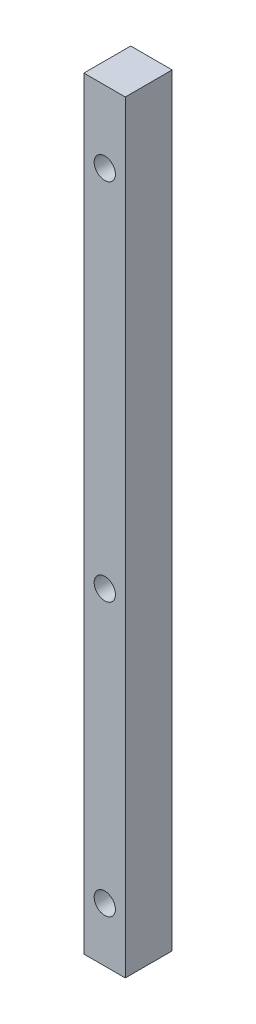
from build123d import *

# Parameters (mm, degrees)
SKETCH1_W           = 9.652
SKETCH1_H           = 177.8
SKETCH1_R           = 2.4765
BOSS_EXTRUDE1_DEPTH = 10.922


with BuildPart() as part:
    # Sketch1 → Boss-Extrude1 (new body)
    with BuildSketch(Plane.XY):
        with Locations((4.826, -88.9)):
            Rectangle(SKETCH1_W, SKETCH1_H)
        with Locations((4.8768, -101.6)):
            Circle(SKETCH1_R, mode=Mode.SUBTRACT)
        with Locations((4.8768, -165.1)):
            Circle(SKETCH1_R, mode=Mode.SUBTRACT)
        with Locations((4.8768, -16.764)):
            Circle(SKETCH1_R, mode=Mode.SUBTRACT)
    extrude(amount=BOSS_EXTRUDE1_DEPTH)


solid = part.part
